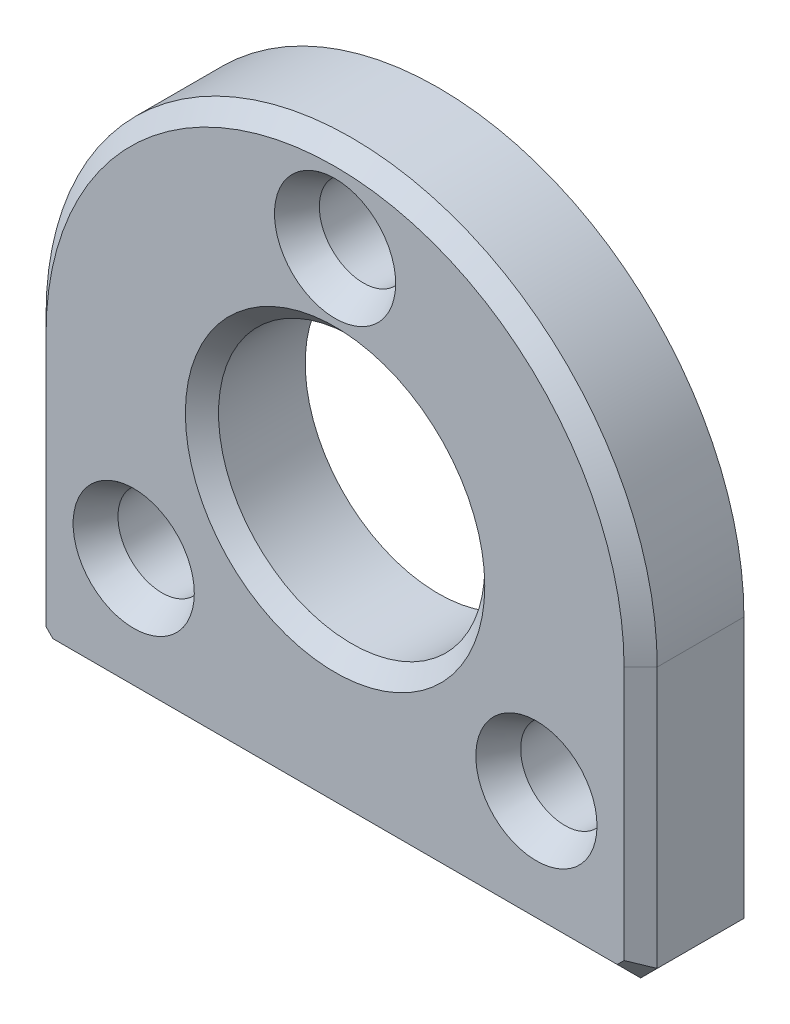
ISO-10303-21;
HEADER;
FILE_DESCRIPTION(('STEP AP214'),'2;1');
FILE_NAME('part.step','',(''),(''),'','','');
FILE_SCHEMA(('AUTOMOTIVE_DESIGN { 1 0 10303 214 1 1 1 1 }'));
ENDSEC;
DATA;
#1=APPLICATION_CONTEXT('core data for automotive mechanical design processes');
#2=APPLICATION_PROTOCOL_DEFINITION('international standard','automotive_design',2000,#1);
#3=PRODUCT_CONTEXT('',#1,'mechanical');
#4=PRODUCT('Part','Part','',(#3));
#5=PRODUCT_RELATED_PRODUCT_CATEGORY('part','',(#4));
#6=PRODUCT_DEFINITION_FORMATION('','',#4);
#7=PRODUCT_DEFINITION_CONTEXT('part definition',#1,'design');
#8=PRODUCT_DEFINITION('design','',#6,#7);
#9=PRODUCT_DEFINITION_SHAPE('','',#8);
#10=(LENGTH_UNIT() NAMED_UNIT(*) SI_UNIT(.MILLI.,.METRE.));
#11=(NAMED_UNIT(*) PLANE_ANGLE_UNIT() SI_UNIT($,.RADIAN.));
#12=(NAMED_UNIT(*) SI_UNIT($,.STERADIAN.) SOLID_ANGLE_UNIT());
#13=UNCERTAINTY_MEASURE_WITH_UNIT(LENGTH_MEASURE(1.E-05),#10,'distance_accuracy_value','');
#14=(GEOMETRIC_REPRESENTATION_CONTEXT(3) GLOBAL_UNCERTAINTY_ASSIGNED_CONTEXT((#13)) GLOBAL_UNIT_ASSIGNED_CONTEXT((#10,
#11,#12)) REPRESENTATION_CONTEXT('',''));
#15=CARTESIAN_POINT('',(0.,0.,0.));
#16=DIRECTION('',(0.,0.,1.));
#17=DIRECTION('',(1.,0.,0.));
#18=AXIS2_PLACEMENT_3D('',#15,#16,#17);
#19=CARTESIAN_POINT('',(0.,-0.0253999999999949,5.5372));
#20=DIRECTION('',(0.,0.,1.));
#21=DIRECTION('',(1.,0.,0.));
#22=AXIS2_PLACEMENT_3D('',#19,#20,#21);
#23=PLANE('',#22);
#24=CARTESIAN_POINT('',(10.795,-8.128,5.5372));
#25=DIRECTION('',(0.,0.,1.));
#26=DIRECTION('',(1.,0.,0.));
#27=AXIS2_PLACEMENT_3D('',#24,#25,#26);
#28=CIRCLE('',#27,3.24843181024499);
#29=CARTESIAN_POINT('',(14.043431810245,-8.128,5.5372));
#30=VERTEX_POINT('',#29);
#31=EDGE_CURVE('E211',#30,#30,#28,.F.);
#32=ORIENTED_EDGE('',*,*,#31,.T.);
#33=EDGE_LOOP('',(#32));
#34=FACE_BOUND('',#33,.T.);
#35=CARTESIAN_POINT('',(0.,11.6586,5.5372));
#36=DIRECTION('',(0.,0.,1.));
#37=DIRECTION('',(1.,0.,0.));
#38=AXIS2_PLACEMENT_3D('',#35,#36,#37);
#39=CIRCLE('',#38,3.24843181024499);
#40=CARTESIAN_POINT('',(3.24843181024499,11.6586,5.5372));
#41=VERTEX_POINT('',#40);
#42=EDGE_CURVE('E208',#41,#41,#39,.F.);
#43=ORIENTED_EDGE('',*,*,#42,.T.);
#44=EDGE_LOOP('',(#43));
#45=FACE_BOUND('',#44,.T.);
#46=CARTESIAN_POINT('',(-10.795,-8.128,5.5372));
#47=DIRECTION('',(0.,0.,1.));
#48=DIRECTION('',(1.,0.,0.));
#49=AXIS2_PLACEMENT_3D('',#46,#47,#48);
#50=CIRCLE('',#49,3.24843181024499);
#51=CARTESIAN_POINT('',(-7.54656818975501,-8.128,5.5372));
#52=VERTEX_POINT('',#51);
#53=EDGE_CURVE('E205',#52,#52,#50,.F.);
#54=ORIENTED_EDGE('',*,*,#53,.T.);
#55=EDGE_LOOP('',(#54));
#56=FACE_BOUND('',#55,.T.);
#57=CARTESIAN_POINT('',(0.,0.,5.5372));
#58=DIRECTION('',(0.,0.,1.));
#59=DIRECTION('',(1.,0.,0.));
#60=AXIS2_PLACEMENT_3D('',#57,#58,#59);
#61=CIRCLE('',#60,8.0264);
#62=CARTESIAN_POINT('',(8.0264,0.,5.5372));
#63=VERTEX_POINT('',#62);
#64=EDGE_CURVE('E171',#63,#63,#61,.F.);
#65=ORIENTED_EDGE('',*,*,#64,.T.);
#66=EDGE_LOOP('',(#65));
#67=FACE_BOUND('',#66,.T.);
#68=DIRECTION('',(0.707106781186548,0.707106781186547,0.));
#69=VECTOR('',#68,1.);
#70=CARTESIAN_POINT('',(15.7543820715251,-13.3921820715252,5.5372));
#71=LINE('',#70,#69);
#72=CARTESIAN_POINT('',(15.1257641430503,-14.0208,5.5372));
#73=VERTEX_POINT('',#72);
#74=CARTESIAN_POINT('',(15.494,-13.6525641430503,5.5372));
#75=VERTEX_POINT('',#74);
#76=EDGE_CURVE('E166',#73,#75,#71,.T.);
#77=ORIENTED_EDGE('',*,*,#76,.T.);
#78=DIRECTION('',(0.,1.,0.));
#79=VECTOR('',#78,1.);
#80=CARTESIAN_POINT('',(15.494,-0.0253999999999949,5.5372));
#81=LINE('',#80,#79);
#82=CARTESIAN_POINT('',(15.494,-0.0253999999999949,5.5372));
#83=VERTEX_POINT('',#82);
#84=EDGE_CURVE('E168',#75,#83,#81,.T.);
#85=ORIENTED_EDGE('',*,*,#84,.T.);
#86=CARTESIAN_POINT('',(0.,-0.0253999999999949,5.5372));
#87=DIRECTION('',(0.,0.,1.));
#88=DIRECTION('',(1.,0.,0.));
#89=AXIS2_PLACEMENT_3D('',#86,#87,#88);
#90=CIRCLE('',#89,15.494);
#91=CARTESIAN_POINT('',(-15.494,-0.025399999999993,5.5372));
#92=VERTEX_POINT('',#91);
#93=EDGE_CURVE('E158',#83,#92,#90,.T.);
#94=ORIENTED_EDGE('',*,*,#93,.T.);
#95=DIRECTION('',(0.,-1.,0.));
#96=VECTOR('',#95,1.);
#97=CARTESIAN_POINT('',(-15.494,-14.0208,5.5372));
#98=LINE('',#97,#96);
#99=CARTESIAN_POINT('',(-15.494,-13.6525641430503,5.5372));
#100=VERTEX_POINT('',#99);
#101=EDGE_CURVE('E160',#92,#100,#98,.T.);
#102=ORIENTED_EDGE('',*,*,#101,.T.);
#103=DIRECTION('',(0.707106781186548,-0.707106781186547,0.));
#104=VECTOR('',#103,1.);
#105=CARTESIAN_POINT('',(-14.8653820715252,-14.2811820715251,5.5372));
#106=LINE('',#105,#104);
#107=CARTESIAN_POINT('',(-15.1257641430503,-14.0208,5.5372));
#108=VERTEX_POINT('',#107);
#109=EDGE_CURVE('E162',#100,#108,#106,.T.);
#110=ORIENTED_EDGE('',*,*,#109,.T.);
#111=DIRECTION('',(1.,0.,0.));
#112=VECTOR('',#111,1.);
#113=CARTESIAN_POINT('',(15.494,-14.0208,5.5372));
#114=LINE('',#113,#112);
#115=EDGE_CURVE('E164',#108,#73,#114,.T.);
#116=ORIENTED_EDGE('',*,*,#115,.T.);
#117=EDGE_LOOP('',(#77,#85,#94,#102,#110,#116));
#118=FACE_BOUND('',#117,.T.);
#119=ADVANCED_FACE('F37',(#34,#45,#56,#67,#118),#23,.T.);
#120=CARTESIAN_POINT('',(0.,-0.0253999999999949,0.));
#121=DIRECTION('',(0.,0.,1.));
#122=DIRECTION('',(1.,0.,0.));
#123=AXIS2_PLACEMENT_3D('',#120,#121,#122);
#124=PLANE('',#123);
#125=CARTESIAN_POINT('',(-10.795,-8.128,0.));
#126=DIRECTION('',(0.,0.,1.));
#127=DIRECTION('',(1.,0.,0.));
#128=AXIS2_PLACEMENT_3D('',#125,#126,#127);
#129=CIRCLE('',#128,2.36855);
#130=CARTESIAN_POINT('',(-8.42645,-8.128,0.));
#131=VERTEX_POINT('',#130);
#132=EDGE_CURVE('E483',#131,#131,#129,.T.);
#133=ORIENTED_EDGE('',*,*,#132,.T.);
#134=EDGE_LOOP('',(#133));
#135=FACE_BOUND('',#134,.T.);
#136=CARTESIAN_POINT('',(0.,0.,0.));
#137=DIRECTION('',(0.,0.,1.));
#138=DIRECTION('',(1.,0.,0.));
#139=AXIS2_PLACEMENT_3D('',#136,#137,#138);
#140=CIRCLE('',#139,7.1374);
#141=CARTESIAN_POINT('',(7.1374,0.,0.));
#142=VERTEX_POINT('',#141);
#143=EDGE_CURVE('E132',#142,#142,#140,.T.);
#144=ORIENTED_EDGE('',*,*,#143,.T.);
#145=EDGE_LOOP('',(#144));
#146=FACE_BOUND('',#145,.T.);
#147=CARTESIAN_POINT('',(0.,-0.0253999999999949,0.));
#148=DIRECTION('',(0.,0.,1.));
#149=DIRECTION('',(1.,0.,0.));
#150=AXIS2_PLACEMENT_3D('',#147,#148,#149);
#151=CIRCLE('',#150,16.383);
#152=CARTESIAN_POINT('',(16.383,-0.0253999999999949,0.));
#153=VERTEX_POINT('',#152);
#154=CARTESIAN_POINT('',(-16.383,-0.0253999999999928,0.));
#155=VERTEX_POINT('',#154);
#156=EDGE_CURVE('E123',#153,#155,#151,.T.);
#157=ORIENTED_EDGE('',*,*,#156,.F.);
#158=DIRECTION('',(0.,1.,0.));
#159=VECTOR('',#158,1.);
#160=CARTESIAN_POINT('',(16.383,-14.0208,0.));
#161=LINE('',#160,#159);
#162=CARTESIAN_POINT('',(16.383,-14.0208,0.));
#163=VERTEX_POINT('',#162);
#164=EDGE_CURVE('E146',#163,#153,#161,.T.);
#165=ORIENTED_EDGE('',*,*,#164,.F.);
#166=DIRECTION('',(0.707106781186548,0.707106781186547,0.));
#167=VECTOR('',#166,1.);
#168=CARTESIAN_POINT('',(15.494,-14.9098,0.));
#169=LINE('',#168,#167);
#170=CARTESIAN_POINT('',(15.494,-14.9098,0.));
#171=VERTEX_POINT('',#170);
#172=EDGE_CURVE('E143',#171,#163,#169,.T.);
#173=ORIENTED_EDGE('',*,*,#172,.F.);
#174=DIRECTION('',(1.,0.,0.));
#175=VECTOR('',#174,1.);
#176=CARTESIAN_POINT('',(-15.494,-14.9098,0.));
#177=LINE('',#176,#175);
#178=CARTESIAN_POINT('',(-15.494,-14.9098,0.));
#179=VERTEX_POINT('',#178);
#180=EDGE_CURVE('E140',#179,#171,#177,.T.);
#181=ORIENTED_EDGE('',*,*,#180,.F.);
#182=DIRECTION('',(0.707106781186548,-0.707106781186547,0.));
#183=VECTOR('',#182,1.);
#184=CARTESIAN_POINT('',(-16.383,-14.0208,0.));
#185=LINE('',#184,#183);
#186=CARTESIAN_POINT('',(-16.383,-14.0208,0.));
#187=VERTEX_POINT('',#186);
#188=EDGE_CURVE('E126',#187,#179,#185,.T.);
#189=ORIENTED_EDGE('',*,*,#188,.F.);
#190=DIRECTION('',(0.,-1.,0.));
#191=VECTOR('',#190,1.);
#192=CARTESIAN_POINT('',(-16.383,-0.0253999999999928,0.));
#193=LINE('',#192,#191);
#194=EDGE_CURVE('E110',#155,#187,#193,.T.);
#195=ORIENTED_EDGE('',*,*,#194,.F.);
#196=EDGE_LOOP('',(#157,#165,#173,#181,#189,#195));
#197=FACE_BOUND('',#196,.T.);
#198=CARTESIAN_POINT('',(0.,11.6586,0.));
#199=DIRECTION('',(0.,0.,1.));
#200=DIRECTION('',(1.,0.,0.));
#201=AXIS2_PLACEMENT_3D('',#198,#199,#200);
#202=CIRCLE('',#201,2.36855);
#203=CARTESIAN_POINT('',(2.36855,11.6586,0.));
#204=VERTEX_POINT('',#203);
#205=EDGE_CURVE('E135',#204,#204,#202,.T.);
#206=ORIENTED_EDGE('',*,*,#205,.T.);
#207=EDGE_LOOP('',(#206));
#208=FACE_BOUND('',#207,.T.);
#209=CARTESIAN_POINT('',(10.795,-8.128,0.));
#210=DIRECTION('',(0.,0.,1.));
#211=DIRECTION('',(1.,0.,0.));
#212=AXIS2_PLACEMENT_3D('',#209,#210,#211);
#213=CIRCLE('',#212,2.36855);
#214=CARTESIAN_POINT('',(13.16355,-8.128,0.));
#215=VERTEX_POINT('',#214);
#216=EDGE_CURVE('E202',#215,#215,#213,.T.);
#217=ORIENTED_EDGE('',*,*,#216,.T.);
#218=EDGE_LOOP('',(#217));
#219=FACE_BOUND('',#218,.T.);
#220=ADVANCED_FACE('F120',(#135,#146,#197,#208,#219),#124,.F.);
#221=CARTESIAN_POINT('',(0.,-0.0253999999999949,5.5372));
#222=DIRECTION('',(0.,0.,-1.));
#223=DIRECTION('',(-1.,0.,0.));
#224=AXIS2_PLACEMENT_3D('',#221,#222,#223);
#225=CYLINDRICAL_SURFACE('',#224,16.383);
#226=DIRECTION('',(0.,0.,-1.));
#227=VECTOR('',#226,1.);
#228=CARTESIAN_POINT('',(-16.383,-0.0253999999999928,5.5372));
#229=LINE('',#228,#227);
#230=CARTESIAN_POINT('',(-16.383,-0.0253999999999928,4.64819999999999));
#231=VERTEX_POINT('',#230);
#232=EDGE_CURVE('E107',#231,#155,#229,.T.);
#233=ORIENTED_EDGE('',*,*,#232,.F.);
#234=CARTESIAN_POINT('',(0.,-0.0253999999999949,4.64819999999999));
#235=DIRECTION('',(0.,0.,1.));
#236=DIRECTION('',(1.,0.,0.));
#237=AXIS2_PLACEMENT_3D('',#234,#235,#236);
#238=CIRCLE('',#237,16.383);
#239=CARTESIAN_POINT('',(16.383,-0.0253999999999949,4.64819999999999));
#240=VERTEX_POINT('',#239);
#241=EDGE_CURVE('E183',#231,#240,#238,.F.);
#242=ORIENTED_EDGE('',*,*,#241,.T.);
#243=DIRECTION('',(0.,0.,-1.));
#244=VECTOR('',#243,1.);
#245=CARTESIAN_POINT('',(16.383,-0.0253999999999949,5.5372));
#246=LINE('',#245,#244);
#247=EDGE_CURVE('E130',#240,#153,#246,.T.);
#248=ORIENTED_EDGE('',*,*,#247,.T.);
#249=ORIENTED_EDGE('',*,*,#156,.T.);
#250=EDGE_LOOP('',(#233,#242,#248,#249));
#251=FACE_BOUND('',#250,.T.);
#252=ADVANCED_FACE('F128',(#251),#225,.T.);
#253=CARTESIAN_POINT('',(-16.383,-0.0253999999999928,5.5372));
#254=DIRECTION('',(1.,0.,0.));
#255=DIRECTION('',(0.,1.,0.));
#256=AXIS2_PLACEMENT_3D('',#253,#254,#255);
#257=PLANE('',#256);
#258=DIRECTION('',(0.,0.,-1.));
#259=VECTOR('',#258,1.);
#260=CARTESIAN_POINT('',(-16.383,-14.0208,5.5372));
#261=LINE('',#260,#259);
#262=CARTESIAN_POINT('',(-16.383,-14.0208,4.64819999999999));
#263=VERTEX_POINT('',#262);
#264=EDGE_CURVE('E116',#263,#187,#261,.T.);
#265=ORIENTED_EDGE('',*,*,#264,.F.);
#266=DIRECTION('',(0.,1.,0.));
#267=VECTOR('',#266,1.);
#268=CARTESIAN_POINT('',(-16.383,-0.0253999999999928,4.64819999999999));
#269=LINE('',#268,#267);
#270=EDGE_CURVE('E52',#263,#231,#269,.T.);
#271=ORIENTED_EDGE('',*,*,#270,.T.);
#272=ORIENTED_EDGE('',*,*,#232,.T.);
#273=ORIENTED_EDGE('',*,*,#194,.T.);
#274=EDGE_LOOP('',(#265,#271,#272,#273));
#275=FACE_BOUND('',#274,.T.);
#276=ADVANCED_FACE('F109',(#275),#257,.F.);
#277=CARTESIAN_POINT('',(-16.383,-14.0208,5.5372));
#278=DIRECTION('',(0.707106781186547,0.707106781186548,0.));
#279=DIRECTION('',(-0.707106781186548,0.707106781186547,0.));
#280=AXIS2_PLACEMENT_3D('',#277,#278,#279);
#281=PLANE('',#280);
#282=DIRECTION('',(0.,0.,-1.));
#283=VECTOR('',#282,1.);
#284=CARTESIAN_POINT('',(-15.494,-14.9098,5.5372));
#285=LINE('',#284,#283);
#286=CARTESIAN_POINT('',(-15.494,-14.9098,4.64819999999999));
#287=VERTEX_POINT('',#286);
#288=EDGE_CURVE('E153',#287,#179,#285,.T.);
#289=ORIENTED_EDGE('',*,*,#288,.F.);
#290=DIRECTION('',(-0.707106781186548,0.707106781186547,0.));
#291=VECTOR('',#290,1.);
#292=CARTESIAN_POINT('',(-16.383,-14.0208,4.64819999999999));
#293=LINE('',#292,#291);
#294=EDGE_CURVE('E60',#287,#263,#293,.T.);
#295=ORIENTED_EDGE('',*,*,#294,.T.);
#296=ORIENTED_EDGE('',*,*,#264,.T.);
#297=ORIENTED_EDGE('',*,*,#188,.T.);
#298=EDGE_LOOP('',(#289,#295,#296,#297));
#299=FACE_BOUND('',#298,.T.);
#300=ADVANCED_FACE('F256',(#299),#281,.F.);
#301=CARTESIAN_POINT('',(-15.494,-14.9098,5.5372));
#302=DIRECTION('',(0.,1.,0.));
#303=DIRECTION('',(0.,0.,1.));
#304=AXIS2_PLACEMENT_3D('',#301,#302,#303);
#305=PLANE('',#304);
#306=DIRECTION('',(0.,0.,-1.));
#307=VECTOR('',#306,1.);
#308=CARTESIAN_POINT('',(15.494,-14.9098,5.5372));
#309=LINE('',#308,#307);
#310=CARTESIAN_POINT('',(15.494,-14.9098,4.64819999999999));
#311=VERTEX_POINT('',#310);
#312=EDGE_CURVE('E151',#311,#171,#309,.T.);
#313=ORIENTED_EDGE('',*,*,#312,.F.);
#314=DIRECTION('',(-1.,0.,0.));
#315=VECTOR('',#314,1.);
#316=CARTESIAN_POINT('',(-15.494,-14.9098,4.64819999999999));
#317=LINE('',#316,#315);
#318=EDGE_CURVE('E179',#311,#287,#317,.T.);
#319=ORIENTED_EDGE('',*,*,#318,.T.);
#320=ORIENTED_EDGE('',*,*,#288,.T.);
#321=ORIENTED_EDGE('',*,*,#180,.T.);
#322=EDGE_LOOP('',(#313,#319,#320,#321));
#323=FACE_BOUND('',#322,.T.);
#324=ADVANCED_FACE('F252',(#323),#305,.F.);
#325=CARTESIAN_POINT('',(15.494,-14.9098,5.5372));
#326=DIRECTION('',(-0.707106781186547,0.707106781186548,0.));
#327=DIRECTION('',(-0.707106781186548,-0.707106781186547,0.));
#328=AXIS2_PLACEMENT_3D('',#325,#326,#327);
#329=PLANE('',#328);
#330=DIRECTION('',(0.,0.,-1.));
#331=VECTOR('',#330,1.);
#332=CARTESIAN_POINT('',(16.383,-14.0208,5.5372));
#333=LINE('',#332,#331);
#334=CARTESIAN_POINT('',(16.383,-14.0208,4.64819999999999));
#335=VERTEX_POINT('',#334);
#336=EDGE_CURVE('E149',#335,#163,#333,.T.);
#337=ORIENTED_EDGE('',*,*,#336,.F.);
#338=DIRECTION('',(-0.707106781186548,-0.707106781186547,0.));
#339=VECTOR('',#338,1.);
#340=CARTESIAN_POINT('',(15.494,-14.9098,4.64819999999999));
#341=LINE('',#340,#339);
#342=EDGE_CURVE('E177',#335,#311,#341,.T.);
#343=ORIENTED_EDGE('',*,*,#342,.T.);
#344=ORIENTED_EDGE('',*,*,#312,.T.);
#345=ORIENTED_EDGE('',*,*,#172,.T.);
#346=EDGE_LOOP('',(#337,#343,#344,#345));
#347=FACE_BOUND('',#346,.T.);
#348=ADVANCED_FACE('F248',(#347),#329,.F.);
#349=CARTESIAN_POINT('',(16.383,-14.0208,5.5372));
#350=DIRECTION('',(-1.,0.,0.));
#351=DIRECTION('',(0.,0.,1.));
#352=AXIS2_PLACEMENT_3D('',#349,#350,#351);
#353=PLANE('',#352);
#354=ORIENTED_EDGE('',*,*,#247,.F.);
#355=DIRECTION('',(0.,-1.,0.));
#356=VECTOR('',#355,1.);
#357=CARTESIAN_POINT('',(16.383,-14.0208,4.64819999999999));
#358=LINE('',#357,#356);
#359=EDGE_CURVE('E174',#240,#335,#358,.T.);
#360=ORIENTED_EDGE('',*,*,#359,.T.);
#361=ORIENTED_EDGE('',*,*,#336,.T.);
#362=ORIENTED_EDGE('',*,*,#164,.T.);
#363=EDGE_LOOP('',(#354,#360,#361,#362));
#364=FACE_BOUND('',#363,.T.);
#365=ADVANCED_FACE('F245',(#364),#353,.F.);
#366=CARTESIAN_POINT('',(0.,0.,5.5372));
#367=DIRECTION('',(0.,0.,-1.));
#368=DIRECTION('',(-1.,0.,0.));
#369=AXIS2_PLACEMENT_3D('',#366,#367,#368);
#370=CYLINDRICAL_SURFACE('',#369,7.1374);
#371=CARTESIAN_POINT('',(0.,0.,4.6482));
#372=DIRECTION('',(0.,0.,1.));
#373=DIRECTION('',(1.,0.,0.));
#374=AXIS2_PLACEMENT_3D('',#371,#372,#373);
#375=CIRCLE('',#374,7.1374);
#376=CARTESIAN_POINT('',(7.1374,0.,4.6482));
#377=VERTEX_POINT('',#376);
#378=EDGE_CURVE('E115',#377,#377,#375,.T.);
#379=ORIENTED_EDGE('',*,*,#378,.T.);
#380=EDGE_LOOP('',(#379));
#381=FACE_BOUND('',#380,.T.);
#382=ORIENTED_EDGE('',*,*,#143,.F.);
#383=EDGE_LOOP('',(#382));
#384=FACE_BOUND('',#383,.T.);
#385=ADVANCED_FACE('F242',(#381,#384),#370,.F.);
#386=CARTESIAN_POINT('',(0.,11.6586,5.5372));
#387=DIRECTION('',(0.,0.,-1.));
#388=DIRECTION('',(-1.,0.,0.));
#389=AXIS2_PLACEMENT_3D('',#386,#387,#388);
#390=CYLINDRICAL_SURFACE('',#389,2.36855);
#391=CARTESIAN_POINT('',(0.,11.6586,4.01319999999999));
#392=DIRECTION('',(0.,0.,1.));
#393=DIRECTION('',(1.,0.,0.));
#394=AXIS2_PLACEMENT_3D('',#391,#392,#393);
#395=CIRCLE('',#394,2.36855);
#396=CARTESIAN_POINT('',(2.36855,11.6586,4.01319999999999));
#397=VERTEX_POINT('',#396);
#398=EDGE_CURVE('E45',#397,#397,#395,.T.);
#399=ORIENTED_EDGE('',*,*,#398,.T.);
#400=EDGE_LOOP('',(#399));
#401=FACE_BOUND('',#400,.T.);
#402=ORIENTED_EDGE('',*,*,#205,.F.);
#403=EDGE_LOOP('',(#402));
#404=FACE_BOUND('',#403,.T.);
#405=ADVANCED_FACE('F216',(#401,#404),#390,.F.);
#406=CARTESIAN_POINT('',(-10.795,-8.128,5.5372));
#407=DIRECTION('',(0.,0.,-1.));
#408=DIRECTION('',(-1.,0.,0.));
#409=AXIS2_PLACEMENT_3D('',#406,#407,#408);
#410=CYLINDRICAL_SURFACE('',#409,2.36855);
#411=CARTESIAN_POINT('',(-10.795,-8.128,4.01319999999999));
#412=DIRECTION('',(0.,0.,1.));
#413=DIRECTION('',(1.,0.,0.));
#414=AXIS2_PLACEMENT_3D('',#411,#412,#413);
#415=CIRCLE('',#414,2.36855);
#416=CARTESIAN_POINT('',(-8.42645,-8.128,4.01319999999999));
#417=VERTEX_POINT('',#416);
#418=EDGE_CURVE('E11',#417,#417,#415,.T.);
#419=ORIENTED_EDGE('',*,*,#418,.T.);
#420=EDGE_LOOP('',(#419));
#421=FACE_BOUND('',#420,.T.);
#422=ORIENTED_EDGE('',*,*,#132,.F.);
#423=EDGE_LOOP('',(#422));
#424=FACE_BOUND('',#423,.T.);
#425=ADVANCED_FACE('F359',(#421,#424),#410,.F.);
#426=CARTESIAN_POINT('',(10.795,-8.128,5.5372));
#427=DIRECTION('',(0.,0.,-1.));
#428=DIRECTION('',(-1.,0.,0.));
#429=AXIS2_PLACEMENT_3D('',#426,#427,#428);
#430=CYLINDRICAL_SURFACE('',#429,2.36855);
#431=CARTESIAN_POINT('',(10.795,-8.128,4.01319999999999));
#432=DIRECTION('',(0.,0.,1.));
#433=DIRECTION('',(1.,0.,0.));
#434=AXIS2_PLACEMENT_3D('',#431,#432,#433);
#435=CIRCLE('',#434,2.36855);
#436=CARTESIAN_POINT('',(13.16355,-8.128,4.01319999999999));
#437=VERTEX_POINT('',#436);
#438=EDGE_CURVE('E185',#437,#437,#435,.T.);
#439=ORIENTED_EDGE('',*,*,#438,.T.);
#440=EDGE_LOOP('',(#439));
#441=FACE_BOUND('',#440,.T.);
#442=ORIENTED_EDGE('',*,*,#216,.F.);
#443=EDGE_LOOP('',(#442));
#444=FACE_BOUND('',#443,.T.);
#445=ADVANCED_FACE('F268',(#441,#444),#430,.F.);
#446=CARTESIAN_POINT('',(0.,0.,4.6482));
#447=DIRECTION('',(0.,0.,1.));
#448=DIRECTION('',(1.,0.,0.));
#449=AXIS2_PLACEMENT_3D('',#446,#447,#448);
#450=CONICAL_SURFACE('',#449,7.1374,0.78539816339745);
#451=ORIENTED_EDGE('',*,*,#64,.F.);
#452=EDGE_LOOP('',(#451));
#453=FACE_BOUND('',#452,.T.);
#454=ORIENTED_EDGE('',*,*,#378,.F.);
#455=EDGE_LOOP('',(#454));
#456=FACE_BOUND('',#455,.T.);
#457=ADVANCED_FACE('F264',(#453,#456),#450,.F.);
#458=CARTESIAN_POINT('',(-14.5605820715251,-14.5859820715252,5.5372));
#459=DIRECTION('',(-0.5,-0.500000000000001,0.707106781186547));
#460=DIRECTION('',(-0.707106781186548,0.707106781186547,0.));
#461=AXIS2_PLACEMENT_3D('',#458,#459,#460);
#462=PLANE('',#461);
#463=DIRECTION('',(0.678598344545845,0.281084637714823,0.678598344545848));
#464=VECTOR('',#463,1.);
#465=CARTESIAN_POINT('',(-12.8947060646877,-12.5759013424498,8.13649393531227));
#466=LINE('',#465,#464);
#467=EDGE_CURVE('E196',#263,#100,#466,.T.);
#468=ORIENTED_EDGE('',*,*,#467,.F.);
#469=ORIENTED_EDGE('',*,*,#294,.F.);
#470=DIRECTION('',(0.281084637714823,0.678598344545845,0.678598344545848));
#471=VECTOR('',#470,1.);
#472=CARTESIAN_POINT('',(-15.1889147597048,-14.1732590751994,5.38474092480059));
#473=LINE('',#472,#471);
#474=EDGE_CURVE('E199',#108,#287,#473,.F.);
#475=ORIENTED_EDGE('',*,*,#474,.F.);
#476=ORIENTED_EDGE('',*,*,#109,.F.);
#477=EDGE_LOOP('',(#468,#469,#475,#476));
#478=FACE_BOUND('',#477,.T.);
#479=ADVANCED_FACE('F267',(#478),#462,.T.);
#480=CARTESIAN_POINT('',(0.,-14.0208,5.5372));
#481=DIRECTION('',(0.,-0.707106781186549,0.707106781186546));
#482=DIRECTION('',(-1.,0.,0.));
#483=AXIS2_PLACEMENT_3D('',#480,#481,#482);
#484=PLANE('',#483);
#485=ORIENTED_EDGE('',*,*,#474,.T.);
#486=ORIENTED_EDGE('',*,*,#318,.F.);
#487=DIRECTION('',(-0.281084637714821,0.678598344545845,0.678598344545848));
#488=VECTOR('',#487,1.);
#489=CARTESIAN_POINT('',(13.9306990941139,-11.1356577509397,8.4223422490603));
#490=LINE('',#489,#488);
#491=EDGE_CURVE('E193',#73,#311,#490,.F.);
#492=ORIENTED_EDGE('',*,*,#491,.F.);
#493=ORIENTED_EDGE('',*,*,#115,.F.);
#494=EDGE_LOOP('',(#485,#486,#492,#493));
#495=FACE_BOUND('',#494,.T.);
#496=ADVANCED_FACE('F284',(#495),#484,.T.);
#497=CARTESIAN_POINT('',(-15.494,-0.025399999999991,5.5372));
#498=DIRECTION('',(-0.707106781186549,0.,0.707106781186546));
#499=DIRECTION('',(0.,1.,0.));
#500=AXIS2_PLACEMENT_3D('',#497,#498,#499);
#501=PLANE('',#500);
#502=ORIENTED_EDGE('',*,*,#467,.T.);
#503=ORIENTED_EDGE('',*,*,#101,.F.);
#504=DIRECTION('',(0.707106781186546,0.,0.707106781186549));
#505=VECTOR('',#504,1.);
#506=CARTESIAN_POINT('',(-16.383,-0.0253999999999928,4.64819999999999));
#507=LINE('',#506,#505);
#508=EDGE_CURVE('E190',#231,#92,#507,.T.);
#509=ORIENTED_EDGE('',*,*,#508,.F.);
#510=ORIENTED_EDGE('',*,*,#270,.F.);
#511=EDGE_LOOP('',(#502,#503,#509,#510));
#512=FACE_BOUND('',#511,.T.);
#513=ADVANCED_FACE('F280',(#512),#501,.T.);
#514=CARTESIAN_POINT('',(14.5605820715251,-14.5859820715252,5.5372));
#515=DIRECTION('',(0.5,-0.500000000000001,0.707106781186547));
#516=DIRECTION('',(-0.707106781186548,-0.707106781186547,0.));
#517=AXIS2_PLACEMENT_3D('',#514,#515,#516);
#518=PLANE('',#517);
#519=ORIENTED_EDGE('',*,*,#491,.T.);
#520=ORIENTED_EDGE('',*,*,#342,.F.);
#521=DIRECTION('',(-0.678598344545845,0.281084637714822,0.678598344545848));
#522=VECTOR('',#521,1.);
#523=CARTESIAN_POINT('',(15.2422085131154,-13.5482686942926,5.78899148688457));
#524=LINE('',#523,#522);
#525=EDGE_CURVE('E188',#75,#335,#524,.F.);
#526=ORIENTED_EDGE('',*,*,#525,.F.);
#527=ORIENTED_EDGE('',*,*,#76,.F.);
#528=EDGE_LOOP('',(#519,#520,#526,#527));
#529=FACE_BOUND('',#528,.T.);
#530=ADVANCED_FACE('F276',(#529),#518,.T.);
#531=CARTESIAN_POINT('',(0.,-0.0253999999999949,5.5372));
#532=DIRECTION('',(0.,0.,-1.));
#533=DIRECTION('',(-1.,0.,0.));
#534=AXIS2_PLACEMENT_3D('',#531,#532,#533);
#535=CONICAL_SURFACE('',#534,15.494,0.785398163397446);
#536=ORIENTED_EDGE('',*,*,#508,.T.);
#537=ORIENTED_EDGE('',*,*,#93,.F.);
#538=DIRECTION('',(-0.707106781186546,0.,0.707106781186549));
#539=VECTOR('',#538,1.);
#540=CARTESIAN_POINT('',(16.383,-0.0253999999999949,4.64819999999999));
#541=LINE('',#540,#539);
#542=EDGE_CURVE('E186',#240,#83,#541,.T.);
#543=ORIENTED_EDGE('',*,*,#542,.F.);
#544=ORIENTED_EDGE('',*,*,#241,.F.);
#545=EDGE_LOOP('',(#536,#537,#543,#544));
#546=FACE_BOUND('',#545,.T.);
#547=ADVANCED_FACE('F272',(#546),#535,.T.);
#548=CARTESIAN_POINT('',(15.494,-0.0253999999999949,5.5372));
#549=DIRECTION('',(0.707106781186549,0.,0.707106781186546));
#550=DIRECTION('',(0.,-1.,0.));
#551=AXIS2_PLACEMENT_3D('',#548,#549,#550);
#552=PLANE('',#551);
#553=ORIENTED_EDGE('',*,*,#525,.T.);
#554=ORIENTED_EDGE('',*,*,#359,.F.);
#555=ORIENTED_EDGE('',*,*,#542,.T.);
#556=ORIENTED_EDGE('',*,*,#84,.F.);
#557=EDGE_LOOP('',(#553,#554,#555,#556));
#558=FACE_BOUND('',#557,.T.);
#559=ADVANCED_FACE('F228',(#558),#552,.T.);
#560=CARTESIAN_POINT('',(10.795,-8.128,4.01319999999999));
#561=DIRECTION('',(0.,0.,1.));
#562=DIRECTION('',(1.,0.,0.));
#563=AXIS2_PLACEMENT_3D('',#560,#561,#562);
#564=CONICAL_SURFACE('',#563,2.36855,0.523598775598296);
#565=ORIENTED_EDGE('',*,*,#31,.F.);
#566=EDGE_LOOP('',(#565));
#567=FACE_BOUND('',#566,.T.);
#568=ORIENTED_EDGE('',*,*,#438,.F.);
#569=EDGE_LOOP('',(#568));
#570=FACE_BOUND('',#569,.T.);
#571=ADVANCED_FACE('F221',(#567,#570),#564,.F.);
#572=CARTESIAN_POINT('',(0.,11.6586,4.01319999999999));
#573=DIRECTION('',(0.,0.,1.));
#574=DIRECTION('',(1.,0.,0.));
#575=AXIS2_PLACEMENT_3D('',#572,#573,#574);
#576=CONICAL_SURFACE('',#575,2.36855,0.523598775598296);
#577=ORIENTED_EDGE('',*,*,#42,.F.);
#578=EDGE_LOOP('',(#577));
#579=FACE_BOUND('',#578,.T.);
#580=ORIENTED_EDGE('',*,*,#398,.F.);
#581=EDGE_LOOP('',(#580));
#582=FACE_BOUND('',#581,.T.);
#583=ADVANCED_FACE('F219',(#579,#582),#576,.F.);
#584=CARTESIAN_POINT('',(-10.795,-8.128,4.01319999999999));
#585=DIRECTION('',(0.,0.,1.));
#586=DIRECTION('',(1.,0.,0.));
#587=AXIS2_PLACEMENT_3D('',#584,#585,#586);
#588=CONICAL_SURFACE('',#587,2.36855,0.523598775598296);
#589=ORIENTED_EDGE('',*,*,#53,.F.);
#590=EDGE_LOOP('',(#589));
#591=FACE_BOUND('',#590,.T.);
#592=ORIENTED_EDGE('',*,*,#418,.F.);
#593=EDGE_LOOP('',(#592));
#594=FACE_BOUND('',#593,.T.);
#595=ADVANCED_FACE('F39',(#591,#594),#588,.F.);
#596=CLOSED_SHELL('',(#119,#220,#252,#276,#300,#324,#348,#365,#385,#405,#425,#445,#457,#479,
#496,#513,#530,#547,#559,#571,#583,#595));
#597=MANIFOLD_SOLID_BREP('B2',#596);
#598=ADVANCED_BREP_SHAPE_REPRESENTATION('',(#18,#597),#14);
#599=SHAPE_DEFINITION_REPRESENTATION(#9,#598);
ENDSEC;
END-ISO-10303-21;
